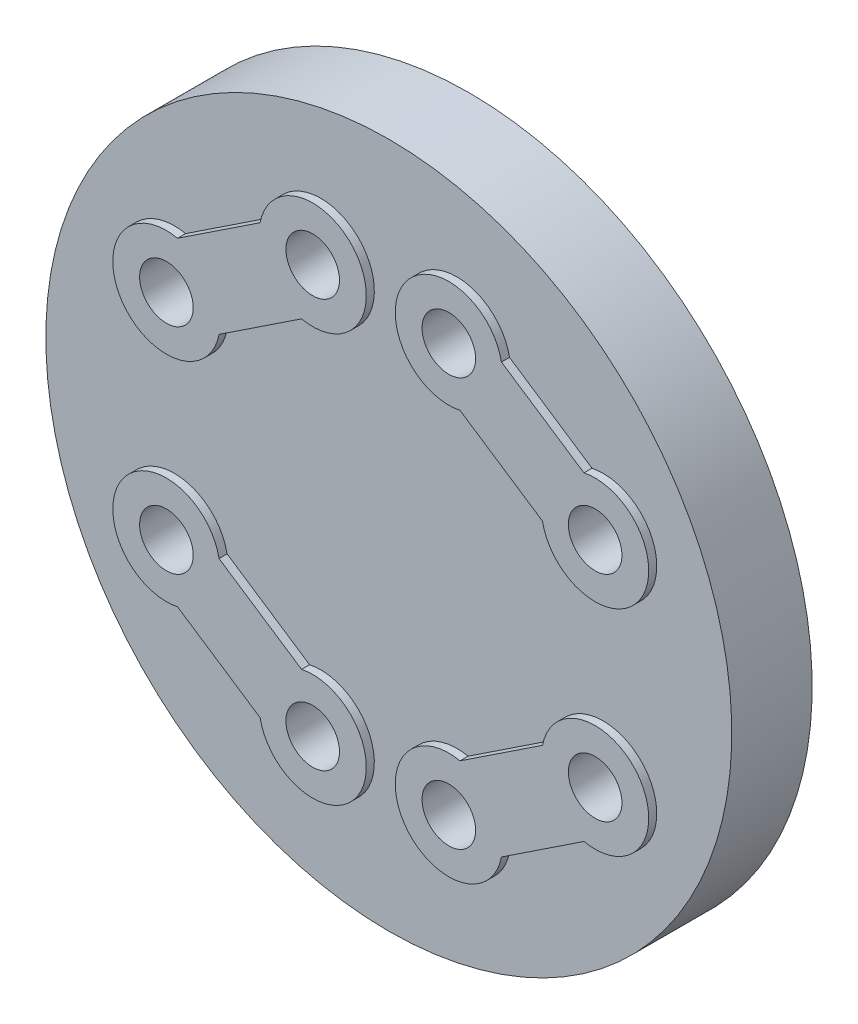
ISO-10303-21;
HEADER;
FILE_DESCRIPTION(('STEP AP214'),'2;1');
FILE_NAME('part.step','',(''),(''),'','','');
FILE_SCHEMA(('AUTOMOTIVE_DESIGN { 1 0 10303 214 1 1 1 1 }'));
ENDSEC;
DATA;
#1=APPLICATION_CONTEXT('core data for automotive mechanical design processes');
#2=APPLICATION_PROTOCOL_DEFINITION('international standard','automotive_design',2000,#1);
#3=PRODUCT_CONTEXT('',#1,'mechanical');
#4=PRODUCT('Part','Part','',(#3));
#5=PRODUCT_RELATED_PRODUCT_CATEGORY('part','',(#4));
#6=PRODUCT_DEFINITION_FORMATION('','',#4);
#7=PRODUCT_DEFINITION_CONTEXT('part definition',#1,'design');
#8=PRODUCT_DEFINITION('design','',#6,#7);
#9=PRODUCT_DEFINITION_SHAPE('','',#8);
#10=(LENGTH_UNIT() NAMED_UNIT(*) SI_UNIT(.MILLI.,.METRE.));
#11=(NAMED_UNIT(*) PLANE_ANGLE_UNIT() SI_UNIT($,.RADIAN.));
#12=(NAMED_UNIT(*) SI_UNIT($,.STERADIAN.) SOLID_ANGLE_UNIT());
#13=UNCERTAINTY_MEASURE_WITH_UNIT(LENGTH_MEASURE(1.E-05),#10,'distance_accuracy_value','');
#14=(GEOMETRIC_REPRESENTATION_CONTEXT(3) GLOBAL_UNCERTAINTY_ASSIGNED_CONTEXT((#13)) GLOBAL_UNIT_ASSIGNED_CONTEXT((#10,
#11,#12)) REPRESENTATION_CONTEXT('',''));
#15=CARTESIAN_POINT('',(0.,0.,0.));
#16=DIRECTION('',(0.,0.,1.));
#17=DIRECTION('',(1.,0.,0.));
#18=AXIS2_PLACEMENT_3D('',#15,#16,#17);
#19=CARTESIAN_POINT('',(-3.79160226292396,-2.978044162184,1.50000000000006));
#20=DIRECTION('',(-0.552584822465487,-0.833456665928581,0.));
#21=DIRECTION('',(0.833456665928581,-0.552584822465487,0.));
#22=AXIS2_PLACEMENT_3D('',#19,#20,#21);
#23=PLANE('',#22);
#24=DIRECTION('',(0.,0.,1.));
#25=VECTOR('',#24,1.);
#26=CARTESIAN_POINT('',(-2.2520164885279,-3.99879517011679,1.50000000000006));
#27=LINE('',#26,#25);
#28=CARTESIAN_POINT('',(-2.25201648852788,-3.9987951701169,1.64999999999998));
#29=VERTEX_POINT('',#28);
#30=CARTESIAN_POINT('',(-2.25201648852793,-3.99879517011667,1.5));
#31=VERTEX_POINT('',#30);
#32=EDGE_CURVE('E179',#29,#31,#27,.F.);
#33=ORIENTED_EDGE('',*,*,#32,.F.);
#34=DIRECTION('',(0.833456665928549,-0.552584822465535,0.));
#35=VECTOR('',#34,1.);
#36=CARTESIAN_POINT('',(-3.79160226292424,-2.97804416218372,1.65000000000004));
#37=LINE('',#36,#35);
#38=CARTESIAN_POINT('',(-3.7916022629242,-2.97804416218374,1.65000000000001));
#39=VERTEX_POINT('',#38);
#40=EDGE_CURVE('E280',#39,#29,#37,.T.);
#41=ORIENTED_EDGE('',*,*,#40,.F.);
#42=DIRECTION('',(0.,0.,1.));
#43=VECTOR('',#42,1.);
#44=CARTESIAN_POINT('',(-3.79160226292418,-2.97804416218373,1.5));
#45=LINE('',#44,#43);
#46=CARTESIAN_POINT('',(-3.79160226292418,-2.97804416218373,1.5));
#47=VERTEX_POINT('',#46);
#48=EDGE_CURVE('E185',#47,#39,#45,.T.);
#49=ORIENTED_EDGE('',*,*,#48,.F.);
#50=DIRECTION('',(-0.833456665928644,0.552584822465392,0.));
#51=VECTOR('',#50,1.);
#52=CARTESIAN_POINT('',(-2.2520164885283,-3.99879517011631,1.5));
#53=LINE('',#52,#51);
#54=EDGE_CURVE('E260',#31,#47,#53,.T.);
#55=ORIENTED_EDGE('',*,*,#54,.F.);
#56=EDGE_LOOP('',(#33,#41,#49,#55));
#57=FACE_BOUND('',#56,.T.);
#58=ADVANCED_FACE('F16',(#57),#23,.T.);
#59=CARTESIAN_POINT('',(-4.,-2.,1.5));
#60=DIRECTION('',(0.,0.,1.));
#61=DIRECTION('',(0.,-1.,0.));
#62=AXIS2_PLACEMENT_3D('',#59,#60,#61);
#63=CYLINDRICAL_SURFACE('',#62,1.);
#64=ORIENTED_EDGE('',*,*,#48,.T.);
#65=CARTESIAN_POINT('',(-4.,-2.,1.64999999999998));
#66=DIRECTION('',(0.,0.,1.));
#67=DIRECTION('',(0.,-1.,0.));
#68=AXIS2_PLACEMENT_3D('',#65,#66,#67);
#69=CIRCLE('',#68,1.);
#70=CARTESIAN_POINT('',(-3.01798351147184,-1.81120482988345,1.64999999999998));
#71=VERTEX_POINT('',#70);
#72=EDGE_CURVE('E281',#71,#39,#69,.T.);
#73=ORIENTED_EDGE('',*,*,#72,.F.);
#74=DIRECTION('',(0.,0.,1.));
#75=VECTOR('',#74,1.);
#76=CARTESIAN_POINT('',(-3.01798351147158,-1.8112048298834,1.5));
#77=LINE('',#76,#75);
#78=CARTESIAN_POINT('',(-3.01798351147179,-1.81120482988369,1.5));
#79=VERTEX_POINT('',#78);
#80=EDGE_CURVE('E183',#79,#71,#77,.T.);
#81=ORIENTED_EDGE('',*,*,#80,.F.);
#82=CARTESIAN_POINT('',(-4.,-2.,1.5));
#83=DIRECTION('',(0.,0.,1.));
#84=DIRECTION('',(0.,-1.,0.));
#85=AXIS2_PLACEMENT_3D('',#82,#83,#84);
#86=CIRCLE('',#85,1.);
#87=EDGE_CURVE('E258',#47,#79,#86,.F.);
#88=ORIENTED_EDGE('',*,*,#87,.F.);
#89=EDGE_LOOP('',(#64,#73,#81,#88));
#90=FACE_BOUND('',#89,.T.);
#91=ADVANCED_FACE('F295',(#90),#63,.T.);
#92=CARTESIAN_POINT('',(-1.47839773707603,-2.83195583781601,1.5));
#93=DIRECTION('',(0.552584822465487,0.833456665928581,0.));
#94=DIRECTION('',(-0.833456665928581,0.552584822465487,0.));
#95=AXIS2_PLACEMENT_3D('',#92,#93,#94);
#96=PLANE('',#95);
#97=ORIENTED_EDGE('',*,*,#80,.T.);
#98=DIRECTION('',(-0.833456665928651,0.552584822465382,0.));
#99=VECTOR('',#98,1.);
#100=CARTESIAN_POINT('',(-1.47839773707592,-2.83195583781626,1.65000000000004));
#101=LINE('',#100,#99);
#102=CARTESIAN_POINT('',(-1.47839773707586,-2.83195583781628,1.65000000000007));
#103=VERTEX_POINT('',#102);
#104=EDGE_CURVE('E152',#103,#71,#101,.T.);
#105=ORIENTED_EDGE('',*,*,#104,.F.);
#106=DIRECTION('',(0.,0.,1.));
#107=VECTOR('',#106,1.);
#108=CARTESIAN_POINT('',(-1.47839773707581,-2.83195583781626,1.50000000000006));
#109=LINE('',#108,#107);
#110=CARTESIAN_POINT('',(-1.47839773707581,-2.83195583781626,1.50000000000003));
#111=VERTEX_POINT('',#110);
#112=EDGE_CURVE('E181',#111,#103,#109,.T.);
#113=ORIENTED_EDGE('',*,*,#112,.F.);
#114=DIRECTION('',(0.833456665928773,-0.552584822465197,0.));
#115=VECTOR('',#114,1.);
#116=CARTESIAN_POINT('',(-3.01798351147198,-1.81120482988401,1.5));
#117=LINE('',#116,#115);
#118=EDGE_CURVE('E257',#79,#111,#117,.T.);
#119=ORIENTED_EDGE('',*,*,#118,.F.);
#120=EDGE_LOOP('',(#97,#105,#113,#119));
#121=FACE_BOUND('',#120,.T.);
#122=ADVANCED_FACE('F308',(#121),#96,.T.);
#123=CARTESIAN_POINT('',(-1.27000000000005,-3.81000000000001,1.50000000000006));
#124=DIRECTION('',(0.,0.,1.));
#125=DIRECTION('',(0.,-1.,0.));
#126=AXIS2_PLACEMENT_3D('',#123,#124,#125);
#127=CYLINDRICAL_SURFACE('',#126,1.);
#128=CARTESIAN_POINT('',(-1.27000000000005,-3.81000000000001,1.6500000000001));
#129=DIRECTION('',(0.,0.,1.));
#130=DIRECTION('',(0.,-1.,0.));
#131=AXIS2_PLACEMENT_3D('',#128,#129,#130);
#132=CIRCLE('',#131,1.);
#133=EDGE_CURVE('E277',#29,#103,#132,.T.);
#134=ORIENTED_EDGE('',*,*,#133,.F.);
#135=ORIENTED_EDGE('',*,*,#32,.T.);
#136=CARTESIAN_POINT('',(-1.27000000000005,-3.81000000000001,1.5));
#137=DIRECTION('',(0.,0.,1.));
#138=DIRECTION('',(0.,-1.,0.));
#139=AXIS2_PLACEMENT_3D('',#136,#137,#138);
#140=CIRCLE('',#139,1.);
#141=EDGE_CURVE('E254',#111,#31,#140,.F.);
#142=ORIENTED_EDGE('',*,*,#141,.F.);
#143=ORIENTED_EDGE('',*,*,#112,.T.);
#144=EDGE_LOOP('',(#134,#135,#142,#143));
#145=FACE_BOUND('',#144,.T.);
#146=ADVANCED_FACE('F303',(#145),#127,.T.);
#147=CARTESIAN_POINT('',(1.26999999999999,-3.81000000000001,1.5));
#148=DIRECTION('',(0.,0.,1.));
#149=DIRECTION('',(0.,-1.,0.));
#150=AXIS2_PLACEMENT_3D('',#147,#148,#149);
#151=CYLINDRICAL_SURFACE('',#150,1.);
#152=DIRECTION('',(0.,0.,1.));
#153=VECTOR('',#152,1.);
#154=CARTESIAN_POINT('',(2.25201648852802,-3.998795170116,1.50000000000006));
#155=LINE('',#154,#153);
#156=CARTESIAN_POINT('',(2.25201648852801,-3.99879517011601,1.65000000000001));
#157=VERTEX_POINT('',#156);
#158=CARTESIAN_POINT('',(2.25201648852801,-3.99879517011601,1.5));
#159=VERTEX_POINT('',#158);
#160=EDGE_CURVE('E139',#157,#159,#155,.F.);
#161=ORIENTED_EDGE('',*,*,#160,.F.);
#162=CARTESIAN_POINT('',(1.26999999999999,-3.81000000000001,1.64999999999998));
#163=DIRECTION('',(0.,0.,1.));
#164=DIRECTION('',(0.,-1.,0.));
#165=AXIS2_PLACEMENT_3D('',#162,#163,#164);
#166=CIRCLE('',#165,1.);
#167=CARTESIAN_POINT('',(1.47839773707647,-2.83195583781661,1.65000000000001));
#168=VERTEX_POINT('',#167);
#169=EDGE_CURVE('E19',#168,#157,#166,.T.);
#170=ORIENTED_EDGE('',*,*,#169,.F.);
#171=DIRECTION('',(0.,0.,1.));
#172=VECTOR('',#171,1.);
#173=CARTESIAN_POINT('',(1.47839773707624,-2.83195583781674,1.5));
#174=LINE('',#173,#172);
#175=CARTESIAN_POINT('',(1.47839773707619,-2.83195583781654,1.5));
#176=VERTEX_POINT('',#175);
#177=EDGE_CURVE('E177',#176,#168,#174,.T.);
#178=ORIENTED_EDGE('',*,*,#177,.F.);
#179=CARTESIAN_POINT('',(1.26999999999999,-3.81000000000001,1.5));
#180=DIRECTION('',(0.,0.,1.));
#181=DIRECTION('',(0.,-1.,0.));
#182=AXIS2_PLACEMENT_3D('',#179,#180,#181);
#183=CIRCLE('',#182,1.);
#184=EDGE_CURVE('E141',#159,#176,#183,.F.);
#185=ORIENTED_EDGE('',*,*,#184,.F.);
#186=EDGE_LOOP('',(#161,#170,#178,#185));
#187=FACE_BOUND('',#186,.T.);
#188=ADVANCED_FACE('F140',(#187),#151,.T.);
#189=CARTESIAN_POINT('',(3.01798351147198,-1.81120482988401,1.5));
#190=DIRECTION('',(-0.552584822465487,0.833456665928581,0.));
#191=DIRECTION('',(-0.833456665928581,-0.552584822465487,0.));
#192=AXIS2_PLACEMENT_3D('',#189,#190,#191);
#193=PLANE('',#192);
#194=ORIENTED_EDGE('',*,*,#177,.T.);
#195=DIRECTION('',(-0.833456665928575,-0.552584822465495,0.));
#196=VECTOR('',#195,1.);
#197=CARTESIAN_POINT('',(3.01798351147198,-1.81120482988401,1.65000000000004));
#198=LINE('',#197,#196);
#199=CARTESIAN_POINT('',(3.017983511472,-1.811204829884,1.65000000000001));
#200=VERTEX_POINT('',#199);
#201=EDGE_CURVE('E135',#200,#168,#198,.T.);
#202=ORIENTED_EDGE('',*,*,#201,.F.);
#203=DIRECTION('',(0.,0.,1.));
#204=VECTOR('',#203,1.);
#205=CARTESIAN_POINT('',(3.017983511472,-1.81120482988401,1.5));
#206=LINE('',#205,#204);
#207=CARTESIAN_POINT('',(3.017983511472,-1.811204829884,1.5));
#208=VERTEX_POINT('',#207);
#209=EDGE_CURVE('E146',#208,#200,#206,.T.);
#210=ORIENTED_EDGE('',*,*,#209,.F.);
#211=DIRECTION('',(0.833456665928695,0.552584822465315,0.));
#212=VECTOR('',#211,1.);
#213=CARTESIAN_POINT('',(1.47839773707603,-2.83195583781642,1.5));
#214=LINE('',#213,#212);
#215=EDGE_CURVE('E252',#176,#208,#214,.T.);
#216=ORIENTED_EDGE('',*,*,#215,.F.);
#217=EDGE_LOOP('',(#194,#202,#210,#216));
#218=FACE_BOUND('',#217,.T.);
#219=ADVANCED_FACE('F414',(#218),#193,.T.);
#220=CARTESIAN_POINT('',(4.,-2.,1.5));
#221=DIRECTION('',(0.,0.,1.));
#222=DIRECTION('',(0.,-1.,0.));
#223=AXIS2_PLACEMENT_3D('',#220,#221,#222);
#224=CYLINDRICAL_SURFACE('',#223,0.999999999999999);
#225=CARTESIAN_POINT('',(4.,-2.,1.64999999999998));
#226=DIRECTION('',(0.,0.,1.));
#227=DIRECTION('',(0.,-1.,0.));
#228=AXIS2_PLACEMENT_3D('',#225,#226,#227);
#229=CIRCLE('',#228,0.999999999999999);
#230=CARTESIAN_POINT('',(3.79160226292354,-2.9780441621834,1.65000000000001));
#231=VERTEX_POINT('',#230);
#232=EDGE_CURVE('E150',#231,#200,#229,.T.);
#233=ORIENTED_EDGE('',*,*,#232,.F.);
#234=DIRECTION('',(0.,0.,1.));
#235=VECTOR('',#234,1.);
#236=CARTESIAN_POINT('',(3.79160226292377,-2.97804416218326,1.50000000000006));
#237=LINE('',#236,#235);
#238=CARTESIAN_POINT('',(3.79160226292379,-2.97804416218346,1.5));
#239=VERTEX_POINT('',#238);
#240=EDGE_CURVE('E145',#239,#231,#237,.T.);
#241=ORIENTED_EDGE('',*,*,#240,.F.);
#242=CARTESIAN_POINT('',(4.,-2.,1.5));
#243=DIRECTION('',(0.,0.,1.));
#244=DIRECTION('',(0.,-1.,0.));
#245=AXIS2_PLACEMENT_3D('',#242,#243,#244);
#246=CIRCLE('',#245,0.999999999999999);
#247=EDGE_CURVE('E249',#208,#239,#246,.F.);
#248=ORIENTED_EDGE('',*,*,#247,.F.);
#249=ORIENTED_EDGE('',*,*,#209,.T.);
#250=EDGE_LOOP('',(#233,#241,#248,#249));
#251=FACE_BOUND('',#250,.T.);
#252=ADVANCED_FACE('F411',(#251),#224,.T.);
#253=CARTESIAN_POINT('',(2.25201648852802,-3.998795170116,1.50000000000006));
#254=DIRECTION('',(0.552584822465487,-0.833456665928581,0.));
#255=DIRECTION('',(0.833456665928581,0.552584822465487,0.));
#256=AXIS2_PLACEMENT_3D('',#253,#254,#255);
#257=PLANE('',#256);
#258=ORIENTED_EDGE('',*,*,#240,.T.);
#259=DIRECTION('',(0.833456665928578,0.552584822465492,0.));
#260=VECTOR('',#259,1.);
#261=CARTESIAN_POINT('',(2.25201648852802,-3.998795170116,1.65000000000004));
#262=LINE('',#261,#260);
#263=EDGE_CURVE('E132',#157,#231,#262,.T.);
#264=ORIENTED_EDGE('',*,*,#263,.F.);
#265=ORIENTED_EDGE('',*,*,#160,.T.);
#266=DIRECTION('',(-0.833456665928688,-0.552584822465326,0.));
#267=VECTOR('',#266,1.);
#268=CARTESIAN_POINT('',(3.79160226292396,-2.97804416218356,1.5));
#269=LINE('',#268,#267);
#270=EDGE_CURVE('E251',#239,#159,#269,.T.);
#271=ORIENTED_EDGE('',*,*,#270,.F.);
#272=EDGE_LOOP('',(#258,#264,#265,#271));
#273=FACE_BOUND('',#272,.T.);
#274=ADVANCED_FACE('F148',(#273),#257,.T.);
#275=CARTESIAN_POINT('',(1.47839773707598,2.83195583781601,1.5));
#276=DIRECTION('',(-0.552584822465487,-0.833456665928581,0.));
#277=DIRECTION('',(0.833456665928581,-0.552584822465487,0.));
#278=AXIS2_PLACEMENT_3D('',#275,#276,#277);
#279=PLANE('',#278);
#280=DIRECTION('',(0.,0.,1.));
#281=VECTOR('',#280,1.);
#282=CARTESIAN_POINT('',(3.01798351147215,1.81120482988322,1.5));
#283=LINE('',#282,#281);
#284=CARTESIAN_POINT('',(3.01798351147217,1.8112048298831,1.64999999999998));
#285=VERTEX_POINT('',#284);
#286=CARTESIAN_POINT('',(3.01798351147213,1.81120482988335,1.5));
#287=VERTEX_POINT('',#286);
#288=EDGE_CURVE('E166',#285,#287,#283,.F.);
#289=ORIENTED_EDGE('',*,*,#288,.F.);
#290=DIRECTION('',(0.833456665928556,-0.552584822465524,0.));
#291=VECTOR('',#290,1.);
#292=CARTESIAN_POINT('',(1.47839773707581,2.83195583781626,1.65000000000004));
#293=LINE('',#292,#291);
#294=CARTESIAN_POINT('',(1.4783977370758,2.83195583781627,1.65000000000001));
#295=VERTEX_POINT('',#294);
#296=EDGE_CURVE('E264',#295,#285,#293,.T.);
#297=ORIENTED_EDGE('',*,*,#296,.F.);
#298=DIRECTION('',(0.,0.,1.));
#299=VECTOR('',#298,1.);
#300=CARTESIAN_POINT('',(1.47839773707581,2.83195583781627,1.5));
#301=LINE('',#300,#299);
#302=CARTESIAN_POINT('',(1.4783977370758,2.83195583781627,1.50000000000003));
#303=VERTEX_POINT('',#302);
#304=EDGE_CURVE('E172',#303,#295,#301,.T.);
#305=ORIENTED_EDGE('',*,*,#304,.F.);
#306=DIRECTION('',(-0.833456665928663,0.552584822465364,0.));
#307=VECTOR('',#306,1.);
#308=CARTESIAN_POINT('',(3.01798351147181,1.81120482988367,1.5));
#309=LINE('',#308,#307);
#310=EDGE_CURVE('E248',#287,#303,#309,.T.);
#311=ORIENTED_EDGE('',*,*,#310,.F.);
#312=EDGE_LOOP('',(#289,#297,#305,#311));
#313=FACE_BOUND('',#312,.T.);
#314=ADVANCED_FACE('F404',(#313),#279,.T.);
#315=CARTESIAN_POINT('',(1.26999999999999,3.81000000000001,1.5));
#316=DIRECTION('',(0.,0.,1.));
#317=DIRECTION('',(0.,-1.,0.));
#318=AXIS2_PLACEMENT_3D('',#315,#316,#317);
#319=CYLINDRICAL_SURFACE('',#318,1.);
#320=ORIENTED_EDGE('',*,*,#304,.T.);
#321=CARTESIAN_POINT('',(1.26999999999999,3.81000000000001,1.64999999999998));
#322=DIRECTION('',(0.,0.,1.));
#323=DIRECTION('',(0.,-1.,0.));
#324=AXIS2_PLACEMENT_3D('',#321,#322,#323);
#325=CIRCLE('',#324,1.);
#326=CARTESIAN_POINT('',(2.25201648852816,3.99879517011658,1.64999999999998));
#327=VERTEX_POINT('',#326);
#328=EDGE_CURVE('E265',#327,#295,#325,.T.);
#329=ORIENTED_EDGE('',*,*,#328,.F.);
#330=DIRECTION('',(0.,0.,1.));
#331=VECTOR('',#330,1.);
#332=CARTESIAN_POINT('',(2.25201648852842,3.99879517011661,1.5));
#333=LINE('',#332,#331);
#334=CARTESIAN_POINT('',(2.25201648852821,3.99879517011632,1.50000000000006));
#335=VERTEX_POINT('',#334);
#336=EDGE_CURVE('E170',#335,#327,#333,.T.);
#337=ORIENTED_EDGE('',*,*,#336,.F.);
#338=CARTESIAN_POINT('',(1.26999999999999,3.81000000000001,1.50000000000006));
#339=DIRECTION('',(0.,0.,1.));
#340=DIRECTION('',(0.,-1.,0.));
#341=AXIS2_PLACEMENT_3D('',#338,#339,#340);
#342=CIRCLE('',#341,1.);
#343=EDGE_CURVE('E246',#303,#335,#342,.F.);
#344=ORIENTED_EDGE('',*,*,#343,.F.);
#345=EDGE_LOOP('',(#320,#329,#337,#344));
#346=FACE_BOUND('',#345,.T.);
#347=ADVANCED_FACE('F400',(#346),#319,.T.);
#348=CARTESIAN_POINT('',(3.79160226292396,2.978044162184,1.5));
#349=DIRECTION('',(0.552584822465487,0.833456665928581,0.));
#350=DIRECTION('',(-0.833456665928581,0.552584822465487,0.));
#351=AXIS2_PLACEMENT_3D('',#348,#349,#350);
#352=PLANE('',#351);
#353=ORIENTED_EDGE('',*,*,#336,.T.);
#354=DIRECTION('',(-0.833456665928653,0.552584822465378,0.));
#355=VECTOR('',#354,1.);
#356=CARTESIAN_POINT('',(3.79160226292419,2.97804416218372,1.65000000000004));
#357=LINE('',#356,#355);
#358=CARTESIAN_POINT('',(3.79160226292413,2.97804416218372,1.64999999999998));
#359=VERTEX_POINT('',#358);
#360=EDGE_CURVE('E268',#359,#327,#357,.T.);
#361=ORIENTED_EDGE('',*,*,#360,.F.);
#362=DIRECTION('',(0.,0.,1.));
#363=VECTOR('',#362,1.);
#364=CARTESIAN_POINT('',(3.79160226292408,2.97804416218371,1.5));
#365=LINE('',#364,#363);
#366=CARTESIAN_POINT('',(3.79160226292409,2.97804416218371,1.5));
#367=VERTEX_POINT('',#366);
#368=EDGE_CURVE('E168',#367,#359,#365,.T.);
#369=ORIENTED_EDGE('',*,*,#368,.F.);
#370=DIRECTION('',(0.833456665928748,-0.552584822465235,0.));
#371=VECTOR('',#370,1.);
#372=CARTESIAN_POINT('',(2.25201648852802,3.998795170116,1.5));
#373=LINE('',#372,#371);
#374=EDGE_CURVE('E245',#335,#367,#373,.T.);
#375=ORIENTED_EDGE('',*,*,#374,.F.);
#376=EDGE_LOOP('',(#353,#361,#369,#375));
#377=FACE_BOUND('',#376,.T.);
#378=ADVANCED_FACE('F396',(#377),#352,.T.);
#379=CARTESIAN_POINT('',(4.,2.,1.5));
#380=DIRECTION('',(0.,0.,1.));
#381=DIRECTION('',(0.,-1.,0.));
#382=AXIS2_PLACEMENT_3D('',#379,#380,#381);
#383=CYLINDRICAL_SURFACE('',#382,0.999999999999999);
#384=CARTESIAN_POINT('',(4.,2.,1.64999999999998));
#385=DIRECTION('',(0.,0.,1.));
#386=DIRECTION('',(0.,-1.,0.));
#387=AXIS2_PLACEMENT_3D('',#384,#385,#386);
#388=CIRCLE('',#387,0.999999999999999);
#389=EDGE_CURVE('E261',#285,#359,#388,.T.);
#390=ORIENTED_EDGE('',*,*,#389,.F.);
#391=ORIENTED_EDGE('',*,*,#288,.T.);
#392=CARTESIAN_POINT('',(4.,2.,1.5));
#393=DIRECTION('',(0.,0.,1.));
#394=DIRECTION('',(0.,-1.,0.));
#395=AXIS2_PLACEMENT_3D('',#392,#393,#394);
#396=CIRCLE('',#395,0.999999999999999);
#397=EDGE_CURVE('E242',#367,#287,#396,.F.);
#398=ORIENTED_EDGE('',*,*,#397,.F.);
#399=ORIENTED_EDGE('',*,*,#368,.T.);
#400=EDGE_LOOP('',(#390,#391,#398,#399));
#401=FACE_BOUND('',#400,.T.);
#402=ADVANCED_FACE('F392',(#401),#383,.T.);
#403=CARTESIAN_POINT('',(-2.25201648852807,3.998795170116,1.5));
#404=DIRECTION('',(-0.552584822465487,0.833456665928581,0.));
#405=DIRECTION('',(-0.833456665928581,-0.552584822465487,0.));
#406=AXIS2_PLACEMENT_3D('',#403,#404,#405);
#407=PLANE('',#406);
#408=DIRECTION('',(0.,0.,1.));
#409=VECTOR('',#408,1.);
#410=CARTESIAN_POINT('',(-3.79160226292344,2.97804416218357,1.5));
#411=LINE('',#410,#409);
#412=CARTESIAN_POINT('',(-3.79160226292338,2.97804416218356,1.65000000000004));
#413=VERTEX_POINT('',#412);
#414=CARTESIAN_POINT('',(-3.79160226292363,2.97804416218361,1.5));
#415=VERTEX_POINT('',#414);
#416=EDGE_CURVE('E158',#413,#415,#411,.F.);
#417=ORIENTED_EDGE('',*,*,#416,.F.);
#418=DIRECTION('',(-0.833456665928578,-0.552584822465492,0.));
#419=VECTOR('',#418,1.);
#420=CARTESIAN_POINT('',(-2.25201648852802,3.998795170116,1.65000000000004));
#421=LINE('',#420,#419);
#422=CARTESIAN_POINT('',(-2.25201648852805,3.99879517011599,1.65000000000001));
#423=VERTEX_POINT('',#422);
#424=EDGE_CURVE('E272',#423,#413,#421,.T.);
#425=ORIENTED_EDGE('',*,*,#424,.F.);
#426=DIRECTION('',(0.,0.,1.));
#427=VECTOR('',#426,1.);
#428=CARTESIAN_POINT('',(-2.25201648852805,3.998795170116,1.50000000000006));
#429=LINE('',#428,#427);
#430=CARTESIAN_POINT('',(-2.25201648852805,3.99879517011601,1.50000000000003));
#431=VERTEX_POINT('',#430);
#432=EDGE_CURVE('E164',#431,#423,#429,.T.);
#433=ORIENTED_EDGE('',*,*,#432,.F.);
#434=DIRECTION('',(0.833456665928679,0.552584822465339,0.));
#435=VECTOR('',#434,1.);
#436=CARTESIAN_POINT('',(-3.79160226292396,2.97804416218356,1.5));
#437=LINE('',#436,#435);
#438=EDGE_CURVE('E241',#415,#431,#437,.T.);
#439=ORIENTED_EDGE('',*,*,#438,.F.);
#440=EDGE_LOOP('',(#417,#425,#433,#439));
#441=FACE_BOUND('',#440,.T.);
#442=ADVANCED_FACE('F388',(#441),#407,.T.);
#443=CARTESIAN_POINT('',(-1.27000000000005,3.81000000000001,1.50000000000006));
#444=DIRECTION('',(0.,0.,1.));
#445=DIRECTION('',(0.,-1.,0.));
#446=AXIS2_PLACEMENT_3D('',#443,#444,#445);
#447=CYLINDRICAL_SURFACE('',#446,1.);
#448=CARTESIAN_POINT('',(-1.27000000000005,3.81000000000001,1.64999999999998));
#449=DIRECTION('',(0.,0.,1.));
#450=DIRECTION('',(0.,-1.,0.));
#451=AXIS2_PLACEMENT_3D('',#448,#449,#450);
#452=CIRCLE('',#451,1.);
#453=CARTESIAN_POINT('',(-1.47839773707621,2.83195583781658,1.64999999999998));
#454=VERTEX_POINT('',#453);
#455=EDGE_CURVE('E273',#454,#423,#452,.T.);
#456=ORIENTED_EDGE('',*,*,#455,.F.);
#457=DIRECTION('',(0.,0.,1.));
#458=VECTOR('',#457,1.);
#459=CARTESIAN_POINT('',(-1.47839773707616,2.83195583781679,1.5));
#460=LINE('',#459,#458);
#461=CARTESIAN_POINT('',(-1.47839773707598,2.83195583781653,1.5));
#462=VERTEX_POINT('',#461);
#463=EDGE_CURVE('E160',#462,#454,#460,.T.);
#464=ORIENTED_EDGE('',*,*,#463,.F.);
#465=CARTESIAN_POINT('',(-1.27000000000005,3.81000000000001,1.5));
#466=DIRECTION('',(0.,0.,1.));
#467=DIRECTION('',(0.,-1.,0.));
#468=AXIS2_PLACEMENT_3D('',#465,#466,#467);
#469=CIRCLE('',#468,1.);
#470=EDGE_CURVE('E239',#431,#462,#469,.F.);
#471=ORIENTED_EDGE('',*,*,#470,.F.);
#472=ORIENTED_EDGE('',*,*,#432,.T.);
#473=EDGE_LOOP('',(#456,#464,#471,#472));
#474=FACE_BOUND('',#473,.T.);
#475=ADVANCED_FACE('F384',(#474),#447,.T.);
#476=CARTESIAN_POINT('',(-3.01798351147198,1.81120482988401,1.5));
#477=DIRECTION('',(0.552584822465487,-0.833456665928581,0.));
#478=DIRECTION('',(0.833456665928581,0.552584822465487,0.));
#479=AXIS2_PLACEMENT_3D('',#476,#477,#478);
#480=PLANE('',#479);
#481=ORIENTED_EDGE('',*,*,#463,.T.);
#482=DIRECTION('',(0.833456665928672,0.55258482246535,0.));
#483=VECTOR('',#482,1.);
#484=CARTESIAN_POINT('',(-3.01798351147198,1.81120482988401,1.65000000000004));
#485=LINE('',#484,#483);
#486=CARTESIAN_POINT('',(-3.017983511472,1.811204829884,1.65000000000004));
#487=VERTEX_POINT('',#486);
#488=EDGE_CURVE('E276',#487,#454,#485,.T.);
#489=ORIENTED_EDGE('',*,*,#488,.F.);
#490=DIRECTION('',(0.,0.,1.));
#491=VECTOR('',#490,1.);
#492=CARTESIAN_POINT('',(-3.017983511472,1.81120482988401,1.5));
#493=LINE('',#492,#491);
#494=CARTESIAN_POINT('',(-3.017983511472,1.811204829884,1.5));
#495=VERTEX_POINT('',#494);
#496=EDGE_CURVE('E157',#495,#487,#493,.T.);
#497=ORIENTED_EDGE('',*,*,#496,.F.);
#498=DIRECTION('',(-0.833456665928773,-0.552584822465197,0.));
#499=VECTOR('',#498,1.);
#500=CARTESIAN_POINT('',(-1.47839773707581,2.83195583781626,1.5));
#501=LINE('',#500,#499);
#502=EDGE_CURVE('E34',#462,#495,#501,.T.);
#503=ORIENTED_EDGE('',*,*,#502,.F.);
#504=EDGE_LOOP('',(#481,#489,#497,#503));
#505=FACE_BOUND('',#504,.T.);
#506=ADVANCED_FACE('F380',(#505),#480,.T.);
#507=CARTESIAN_POINT('',(-4.,2.,1.5));
#508=DIRECTION('',(0.,0.,1.));
#509=DIRECTION('',(0.,-1.,0.));
#510=AXIS2_PLACEMENT_3D('',#507,#508,#509);
#511=CYLINDRICAL_SURFACE('',#510,1.);
#512=ORIENTED_EDGE('',*,*,#496,.T.);
#513=CARTESIAN_POINT('',(-4.,2.,1.65000000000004));
#514=DIRECTION('',(0.,0.,1.));
#515=DIRECTION('',(0.,-1.,0.));
#516=AXIS2_PLACEMENT_3D('',#513,#514,#515);
#517=CIRCLE('',#516,1.);
#518=EDGE_CURVE('E269',#413,#487,#517,.T.);
#519=ORIENTED_EDGE('',*,*,#518,.F.);
#520=ORIENTED_EDGE('',*,*,#416,.T.);
#521=CARTESIAN_POINT('',(-4.,2.,1.5));
#522=DIRECTION('',(0.,0.,1.));
#523=DIRECTION('',(0.,-1.,0.));
#524=AXIS2_PLACEMENT_3D('',#521,#522,#523);
#525=CIRCLE('',#524,1.);
#526=EDGE_CURVE('E237',#495,#415,#525,.F.);
#527=ORIENTED_EDGE('',*,*,#526,.F.);
#528=EDGE_LOOP('',(#512,#519,#520,#527));
#529=FACE_BOUND('',#528,.T.);
#530=ADVANCED_FACE('F377',(#529),#511,.T.);
#531=CARTESIAN_POINT('',(0.,0.,1.65000000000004));
#532=DIRECTION('',(0.,0.,1.));
#533=DIRECTION('',(0.,-1.,0.));
#534=AXIS2_PLACEMENT_3D('',#531,#532,#533);
#535=PLANE('',#534);
#536=ORIENTED_EDGE('',*,*,#263,.T.);
#537=ORIENTED_EDGE('',*,*,#232,.T.);
#538=ORIENTED_EDGE('',*,*,#201,.T.);
#539=ORIENTED_EDGE('',*,*,#169,.T.);
#540=EDGE_LOOP('',(#536,#537,#538,#539));
#541=FACE_BOUND('',#540,.T.);
#542=CARTESIAN_POINT('',(1.26999999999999,-3.81000000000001,1.6500000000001));
#543=DIRECTION('',(0.,0.,1.));
#544=DIRECTION('',(0.,-1.,0.));
#545=AXIS2_PLACEMENT_3D('',#542,#543,#544);
#546=CIRCLE('',#545,0.5);
#547=CARTESIAN_POINT('',(1.26999999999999,-4.31000000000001,1.6500000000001));
#548=VERTEX_POINT('',#547);
#549=EDGE_CURVE('E231',#548,#548,#546,.F.);
#550=ORIENTED_EDGE('',*,*,#549,.T.);
#551=EDGE_LOOP('',(#550));
#552=FACE_BOUND('',#551,.T.);
#553=CARTESIAN_POINT('',(4.,-2.,1.64999999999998));
#554=DIRECTION('',(0.,0.,1.));
#555=DIRECTION('',(0.,-1.,0.));
#556=AXIS2_PLACEMENT_3D('',#553,#554,#555);
#557=CIRCLE('',#556,0.5);
#558=CARTESIAN_POINT('',(4.,-2.5,1.64999999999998));
#559=VERTEX_POINT('',#558);
#560=EDGE_CURVE('E234',#559,#559,#557,.F.);
#561=ORIENTED_EDGE('',*,*,#560,.T.);
#562=EDGE_LOOP('',(#561));
#563=FACE_BOUND('',#562,.T.);
#564=ADVANCED_FACE('F128',(#541,#552,#563),#535,.T.);
#565=CARTESIAN_POINT('',(0.,0.,1.65000000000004));
#566=DIRECTION('',(0.,0.,1.));
#567=DIRECTION('',(0.,-1.,0.));
#568=AXIS2_PLACEMENT_3D('',#565,#566,#567);
#569=PLANE('',#568);
#570=ORIENTED_EDGE('',*,*,#40,.T.);
#571=ORIENTED_EDGE('',*,*,#133,.T.);
#572=ORIENTED_EDGE('',*,*,#104,.T.);
#573=ORIENTED_EDGE('',*,*,#72,.T.);
#574=EDGE_LOOP('',(#570,#571,#572,#573));
#575=FACE_BOUND('',#574,.T.);
#576=CARTESIAN_POINT('',(-1.27000000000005,-3.81000000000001,1.64999999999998));
#577=DIRECTION('',(0.,0.,1.));
#578=DIRECTION('',(0.,-1.,0.));
#579=AXIS2_PLACEMENT_3D('',#576,#577,#578);
#580=CIRCLE('',#579,0.5);
#581=CARTESIAN_POINT('',(-1.27000000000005,-4.31000000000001,1.64999999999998));
#582=VERTEX_POINT('',#581);
#583=EDGE_CURVE('E228',#582,#582,#580,.F.);
#584=ORIENTED_EDGE('',*,*,#583,.T.);
#585=EDGE_LOOP('',(#584));
#586=FACE_BOUND('',#585,.T.);
#587=CARTESIAN_POINT('',(-4.,-2.,1.64999999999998));
#588=DIRECTION('',(0.,0.,1.));
#589=DIRECTION('',(0.,-1.,0.));
#590=AXIS2_PLACEMENT_3D('',#587,#588,#589);
#591=CIRCLE('',#590,0.5);
#592=CARTESIAN_POINT('',(-4.,-2.5,1.64999999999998));
#593=VERTEX_POINT('',#592);
#594=EDGE_CURVE('E225',#593,#593,#591,.F.);
#595=ORIENTED_EDGE('',*,*,#594,.T.);
#596=EDGE_LOOP('',(#595));
#597=FACE_BOUND('',#596,.T.);
#598=ADVANCED_FACE('F289',(#575,#586,#597),#569,.T.);
#599=CARTESIAN_POINT('',(0.,0.,1.65000000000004));
#600=DIRECTION('',(0.,0.,1.));
#601=DIRECTION('',(0.,-1.,0.));
#602=AXIS2_PLACEMENT_3D('',#599,#600,#601);
#603=PLANE('',#602);
#604=ORIENTED_EDGE('',*,*,#424,.T.);
#605=ORIENTED_EDGE('',*,*,#518,.T.);
#606=ORIENTED_EDGE('',*,*,#488,.T.);
#607=ORIENTED_EDGE('',*,*,#455,.T.);
#608=EDGE_LOOP('',(#604,#605,#606,#607));
#609=FACE_BOUND('',#608,.T.);
#610=CARTESIAN_POINT('',(-1.27000000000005,3.81000000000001,1.64999999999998));
#611=DIRECTION('',(0.,0.,1.));
#612=DIRECTION('',(0.,-1.,0.));
#613=AXIS2_PLACEMENT_3D('',#610,#611,#612);
#614=CIRCLE('',#613,0.5);
#615=CARTESIAN_POINT('',(-1.27000000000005,3.31000000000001,1.64999999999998));
#616=VERTEX_POINT('',#615);
#617=EDGE_CURVE('E219',#616,#616,#614,.F.);
#618=ORIENTED_EDGE('',*,*,#617,.T.);
#619=EDGE_LOOP('',(#618));
#620=FACE_BOUND('',#619,.T.);
#621=CARTESIAN_POINT('',(-4.,2.,1.64999999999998));
#622=DIRECTION('',(0.,0.,1.));
#623=DIRECTION('',(0.,-1.,0.));
#624=AXIS2_PLACEMENT_3D('',#621,#622,#623);
#625=CIRCLE('',#624,0.5);
#626=CARTESIAN_POINT('',(-4.,1.5,1.64999999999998));
#627=VERTEX_POINT('',#626);
#628=EDGE_CURVE('E222',#627,#627,#625,.F.);
#629=ORIENTED_EDGE('',*,*,#628,.T.);
#630=EDGE_LOOP('',(#629));
#631=FACE_BOUND('',#630,.T.);
#632=ADVANCED_FACE('F368',(#609,#620,#631),#603,.T.);
#633=CARTESIAN_POINT('',(0.,0.,1.65000000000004));
#634=DIRECTION('',(0.,0.,1.));
#635=DIRECTION('',(0.,-1.,0.));
#636=AXIS2_PLACEMENT_3D('',#633,#634,#635);
#637=PLANE('',#636);
#638=ORIENTED_EDGE('',*,*,#296,.T.);
#639=ORIENTED_EDGE('',*,*,#389,.T.);
#640=ORIENTED_EDGE('',*,*,#360,.T.);
#641=ORIENTED_EDGE('',*,*,#328,.T.);
#642=EDGE_LOOP('',(#638,#639,#640,#641));
#643=FACE_BOUND('',#642,.T.);
#644=CARTESIAN_POINT('',(1.26999999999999,3.81000000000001,1.6500000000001));
#645=DIRECTION('',(0.,0.,1.));
#646=DIRECTION('',(0.,-1.,0.));
#647=AXIS2_PLACEMENT_3D('',#644,#645,#646);
#648=CIRCLE('',#647,0.5);
#649=CARTESIAN_POINT('',(1.26999999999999,3.31000000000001,1.6500000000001));
#650=VERTEX_POINT('',#649);
#651=EDGE_CURVE('E216',#650,#650,#648,.F.);
#652=ORIENTED_EDGE('',*,*,#651,.T.);
#653=EDGE_LOOP('',(#652));
#654=FACE_BOUND('',#653,.T.);
#655=CARTESIAN_POINT('',(4.,2.,1.64999999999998));
#656=DIRECTION('',(0.,0.,1.));
#657=DIRECTION('',(0.,-1.,0.));
#658=AXIS2_PLACEMENT_3D('',#655,#656,#657);
#659=CIRCLE('',#658,0.5);
#660=CARTESIAN_POINT('',(4.,1.5,1.64999999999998));
#661=VERTEX_POINT('',#660);
#662=EDGE_CURVE('E213',#661,#661,#659,.F.);
#663=ORIENTED_EDGE('',*,*,#662,.T.);
#664=EDGE_LOOP('',(#663));
#665=FACE_BOUND('',#664,.T.);
#666=ADVANCED_FACE('F364',(#643,#654,#665),#637,.T.);
#667=CARTESIAN_POINT('',(0.,0.,1.5));
#668=DIRECTION('',(0.,0.,1.));
#669=DIRECTION('',(0.,-1.,0.));
#670=AXIS2_PLACEMENT_3D('',#667,#668,#669);
#671=PLANE('',#670);
#672=CARTESIAN_POINT('',(0.,0.,1.5));
#673=DIRECTION('',(0.,0.,1.));
#674=DIRECTION('',(0.,-1.,0.));
#675=AXIS2_PLACEMENT_3D('',#672,#673,#674);
#676=CIRCLE('',#675,6.4);
#677=CARTESIAN_POINT('',(0.,-6.4,1.5));
#678=VERTEX_POINT('',#677);
#679=EDGE_CURVE('E210',#678,#678,#676,.F.);
#680=ORIENTED_EDGE('',*,*,#679,.F.);
#681=EDGE_LOOP('',(#680));
#682=FACE_BOUND('',#681,.T.);
#683=ORIENTED_EDGE('',*,*,#502,.T.);
#684=ORIENTED_EDGE('',*,*,#526,.T.);
#685=ORIENTED_EDGE('',*,*,#438,.T.);
#686=ORIENTED_EDGE('',*,*,#470,.T.);
#687=EDGE_LOOP('',(#683,#684,#685,#686));
#688=FACE_BOUND('',#687,.T.);
#689=ORIENTED_EDGE('',*,*,#374,.T.);
#690=ORIENTED_EDGE('',*,*,#397,.T.);
#691=ORIENTED_EDGE('',*,*,#310,.T.);
#692=ORIENTED_EDGE('',*,*,#343,.T.);
#693=EDGE_LOOP('',(#689,#690,#691,#692));
#694=FACE_BOUND('',#693,.T.);
#695=ORIENTED_EDGE('',*,*,#247,.T.);
#696=ORIENTED_EDGE('',*,*,#270,.T.);
#697=ORIENTED_EDGE('',*,*,#184,.T.);
#698=ORIENTED_EDGE('',*,*,#215,.T.);
#699=EDGE_LOOP('',(#695,#696,#697,#698));
#700=FACE_BOUND('',#699,.T.);
#701=ORIENTED_EDGE('',*,*,#118,.T.);
#702=ORIENTED_EDGE('',*,*,#141,.T.);
#703=ORIENTED_EDGE('',*,*,#54,.T.);
#704=ORIENTED_EDGE('',*,*,#87,.T.);
#705=EDGE_LOOP('',(#701,#702,#703,#704));
#706=FACE_BOUND('',#705,.T.);
#707=ADVANCED_FACE('F306',(#682,#688,#694,#700,#706),#671,.T.);
#708=CARTESIAN_POINT('',(4.,-2.,1.5));
#709=DIRECTION('',(0.,0.,1.));
#710=DIRECTION('',(0.,-1.,0.));
#711=AXIS2_PLACEMENT_3D('',#708,#709,#710);
#712=CYLINDRICAL_SURFACE('',#711,0.5);
#713=ORIENTED_EDGE('',*,*,#560,.F.);
#714=EDGE_LOOP('',(#713));
#715=FACE_BOUND('',#714,.T.);
#716=CARTESIAN_POINT('',(4.,-2.,0.));
#717=DIRECTION('',(0.,0.,1.));
#718=DIRECTION('',(0.,-1.,0.));
#719=AXIS2_PLACEMENT_3D('',#716,#717,#718);
#720=CIRCLE('',#719,0.5);
#721=CARTESIAN_POINT('',(4.,-2.5,0.));
#722=VERTEX_POINT('',#721);
#723=EDGE_CURVE('E207',#722,#722,#720,.F.);
#724=ORIENTED_EDGE('',*,*,#723,.T.);
#725=EDGE_LOOP('',(#724));
#726=FACE_BOUND('',#725,.T.);
#727=ADVANCED_FACE('F357',(#715,#726),#712,.F.);
#728=CARTESIAN_POINT('',(1.26999999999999,-3.81000000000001,1.5));
#729=DIRECTION('',(0.,0.,1.));
#730=DIRECTION('',(0.,-1.,0.));
#731=AXIS2_PLACEMENT_3D('',#728,#729,#730);
#732=CYLINDRICAL_SURFACE('',#731,0.5);
#733=ORIENTED_EDGE('',*,*,#549,.F.);
#734=EDGE_LOOP('',(#733));
#735=FACE_BOUND('',#734,.T.);
#736=CARTESIAN_POINT('',(1.26999999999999,-3.81000000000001,0.));
#737=DIRECTION('',(0.,0.,1.));
#738=DIRECTION('',(0.,-1.,0.));
#739=AXIS2_PLACEMENT_3D('',#736,#737,#738);
#740=CIRCLE('',#739,0.5);
#741=CARTESIAN_POINT('',(1.26999999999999,-4.31000000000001,0.));
#742=VERTEX_POINT('',#741);
#743=EDGE_CURVE('E204',#742,#742,#740,.F.);
#744=ORIENTED_EDGE('',*,*,#743,.T.);
#745=EDGE_LOOP('',(#744));
#746=FACE_BOUND('',#745,.T.);
#747=ADVANCED_FACE('F353',(#735,#746),#732,.F.);
#748=CARTESIAN_POINT('',(-1.27000000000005,-3.81000000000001,1.50000000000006));
#749=DIRECTION('',(0.,0.,1.));
#750=DIRECTION('',(0.,-1.,0.));
#751=AXIS2_PLACEMENT_3D('',#748,#749,#750);
#752=CYLINDRICAL_SURFACE('',#751,0.5);
#753=ORIENTED_EDGE('',*,*,#583,.F.);
#754=EDGE_LOOP('',(#753));
#755=FACE_BOUND('',#754,.T.);
#756=CARTESIAN_POINT('',(-1.27000000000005,-3.81000000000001,0.));
#757=DIRECTION('',(0.,0.,1.));
#758=DIRECTION('',(0.,-1.,0.));
#759=AXIS2_PLACEMENT_3D('',#756,#757,#758);
#760=CIRCLE('',#759,0.5);
#761=CARTESIAN_POINT('',(-1.27000000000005,-4.31000000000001,0.));
#762=VERTEX_POINT('',#761);
#763=EDGE_CURVE('E201',#762,#762,#760,.F.);
#764=ORIENTED_EDGE('',*,*,#763,.T.);
#765=EDGE_LOOP('',(#764));
#766=FACE_BOUND('',#765,.T.);
#767=ADVANCED_FACE('F349',(#755,#766),#752,.F.);
#768=CARTESIAN_POINT('',(-4.,-2.,1.5));
#769=DIRECTION('',(0.,0.,1.));
#770=DIRECTION('',(0.,-1.,0.));
#771=AXIS2_PLACEMENT_3D('',#768,#769,#770);
#772=CYLINDRICAL_SURFACE('',#771,0.5);
#773=ORIENTED_EDGE('',*,*,#594,.F.);
#774=EDGE_LOOP('',(#773));
#775=FACE_BOUND('',#774,.T.);
#776=CARTESIAN_POINT('',(-4.,-2.,0.));
#777=DIRECTION('',(0.,0.,1.));
#778=DIRECTION('',(0.,-1.,0.));
#779=AXIS2_PLACEMENT_3D('',#776,#777,#778);
#780=CIRCLE('',#779,0.5);
#781=CARTESIAN_POINT('',(-4.,-2.5,0.));
#782=VERTEX_POINT('',#781);
#783=EDGE_CURVE('E198',#782,#782,#780,.F.);
#784=ORIENTED_EDGE('',*,*,#783,.T.);
#785=EDGE_LOOP('',(#784));
#786=FACE_BOUND('',#785,.T.);
#787=ADVANCED_FACE('F345',(#775,#786),#772,.F.);
#788=CARTESIAN_POINT('',(-4.,2.,1.5));
#789=DIRECTION('',(0.,0.,1.));
#790=DIRECTION('',(0.,-1.,0.));
#791=AXIS2_PLACEMENT_3D('',#788,#789,#790);
#792=CYLINDRICAL_SURFACE('',#791,0.5);
#793=ORIENTED_EDGE('',*,*,#628,.F.);
#794=EDGE_LOOP('',(#793));
#795=FACE_BOUND('',#794,.T.);
#796=CARTESIAN_POINT('',(-4.,2.,0.));
#797=DIRECTION('',(0.,0.,1.));
#798=DIRECTION('',(0.,-1.,0.));
#799=AXIS2_PLACEMENT_3D('',#796,#797,#798);
#800=CIRCLE('',#799,0.5);
#801=CARTESIAN_POINT('',(-4.,1.5,0.));
#802=VERTEX_POINT('',#801);
#803=EDGE_CURVE('E195',#802,#802,#800,.F.);
#804=ORIENTED_EDGE('',*,*,#803,.T.);
#805=EDGE_LOOP('',(#804));
#806=FACE_BOUND('',#805,.T.);
#807=ADVANCED_FACE('F341',(#795,#806),#792,.F.);
#808=CARTESIAN_POINT('',(-1.27000000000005,3.81000000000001,1.50000000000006));
#809=DIRECTION('',(0.,0.,1.));
#810=DIRECTION('',(0.,-1.,0.));
#811=AXIS2_PLACEMENT_3D('',#808,#809,#810);
#812=CYLINDRICAL_SURFACE('',#811,0.5);
#813=ORIENTED_EDGE('',*,*,#617,.F.);
#814=EDGE_LOOP('',(#813));
#815=FACE_BOUND('',#814,.T.);
#816=CARTESIAN_POINT('',(-1.27000000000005,3.81000000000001,0.));
#817=DIRECTION('',(0.,0.,1.));
#818=DIRECTION('',(0.,-1.,0.));
#819=AXIS2_PLACEMENT_3D('',#816,#817,#818);
#820=CIRCLE('',#819,0.5);
#821=CARTESIAN_POINT('',(-1.27000000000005,3.31000000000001,0.));
#822=VERTEX_POINT('',#821);
#823=EDGE_CURVE('E192',#822,#822,#820,.F.);
#824=ORIENTED_EDGE('',*,*,#823,.T.);
#825=EDGE_LOOP('',(#824));
#826=FACE_BOUND('',#825,.T.);
#827=ADVANCED_FACE('F337',(#815,#826),#812,.F.);
#828=CARTESIAN_POINT('',(1.26999999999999,3.81000000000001,1.5));
#829=DIRECTION('',(0.,0.,1.));
#830=DIRECTION('',(0.,-1.,0.));
#831=AXIS2_PLACEMENT_3D('',#828,#829,#830);
#832=CYLINDRICAL_SURFACE('',#831,0.5);
#833=ORIENTED_EDGE('',*,*,#651,.F.);
#834=EDGE_LOOP('',(#833));
#835=FACE_BOUND('',#834,.T.);
#836=CARTESIAN_POINT('',(1.26999999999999,3.81000000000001,0.));
#837=DIRECTION('',(0.,0.,1.));
#838=DIRECTION('',(0.,-1.,0.));
#839=AXIS2_PLACEMENT_3D('',#836,#837,#838);
#840=CIRCLE('',#839,0.5);
#841=CARTESIAN_POINT('',(1.26999999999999,3.31000000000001,0.));
#842=VERTEX_POINT('',#841);
#843=EDGE_CURVE('E189',#842,#842,#840,.F.);
#844=ORIENTED_EDGE('',*,*,#843,.T.);
#845=EDGE_LOOP('',(#844));
#846=FACE_BOUND('',#845,.T.);
#847=ADVANCED_FACE('F333',(#835,#846),#832,.F.);
#848=CARTESIAN_POINT('',(4.,2.,1.5));
#849=DIRECTION('',(0.,0.,1.));
#850=DIRECTION('',(0.,-1.,0.));
#851=AXIS2_PLACEMENT_3D('',#848,#849,#850);
#852=CYLINDRICAL_SURFACE('',#851,0.5);
#853=ORIENTED_EDGE('',*,*,#662,.F.);
#854=EDGE_LOOP('',(#853));
#855=FACE_BOUND('',#854,.T.);
#856=CARTESIAN_POINT('',(4.,2.,0.));
#857=DIRECTION('',(0.,0.,1.));
#858=DIRECTION('',(0.,-1.,0.));
#859=AXIS2_PLACEMENT_3D('',#856,#857,#858);
#860=CIRCLE('',#859,0.5);
#861=CARTESIAN_POINT('',(4.,1.5,0.));
#862=VERTEX_POINT('',#861);
#863=EDGE_CURVE('E25',#862,#862,#860,.F.);
#864=ORIENTED_EDGE('',*,*,#863,.T.);
#865=EDGE_LOOP('',(#864));
#866=FACE_BOUND('',#865,.T.);
#867=ADVANCED_FACE('F325',(#855,#866),#852,.F.);
#868=CARTESIAN_POINT('',(0.,0.,0.));
#869=DIRECTION('',(0.,0.,1.));
#870=DIRECTION('',(0.,-1.,0.));
#871=AXIS2_PLACEMENT_3D('',#868,#869,#870);
#872=CYLINDRICAL_SURFACE('',#871,6.4);
#873=ORIENTED_EDGE('',*,*,#679,.T.);
#874=EDGE_LOOP('',(#873));
#875=FACE_BOUND('',#874,.T.);
#876=CARTESIAN_POINT('',(0.,0.,0.));
#877=DIRECTION('',(0.,0.,1.));
#878=DIRECTION('',(0.,-1.,0.));
#879=AXIS2_PLACEMENT_3D('',#876,#877,#878);
#880=CIRCLE('',#879,6.4);
#881=CARTESIAN_POINT('',(0.,-6.4,0.));
#882=VERTEX_POINT('',#881);
#883=EDGE_CURVE('E11',#882,#882,#880,.T.);
#884=ORIENTED_EDGE('',*,*,#883,.T.);
#885=EDGE_LOOP('',(#884));
#886=FACE_BOUND('',#885,.T.);
#887=ADVANCED_FACE('F319',(#875,#886),#872,.T.);
#888=CARTESIAN_POINT('',(0.,0.,0.));
#889=DIRECTION('',(0.,0.,1.));
#890=DIRECTION('',(0.,-1.,0.));
#891=AXIS2_PLACEMENT_3D('',#888,#889,#890);
#892=PLANE('',#891);
#893=ORIENTED_EDGE('',*,*,#883,.F.);
#894=EDGE_LOOP('',(#893));
#895=FACE_BOUND('',#894,.T.);
#896=ORIENTED_EDGE('',*,*,#863,.F.);
#897=EDGE_LOOP('',(#896));
#898=FACE_BOUND('',#897,.T.);
#899=ORIENTED_EDGE('',*,*,#843,.F.);
#900=EDGE_LOOP('',(#899));
#901=FACE_BOUND('',#900,.T.);
#902=ORIENTED_EDGE('',*,*,#823,.F.);
#903=EDGE_LOOP('',(#902));
#904=FACE_BOUND('',#903,.T.);
#905=ORIENTED_EDGE('',*,*,#803,.F.);
#906=EDGE_LOOP('',(#905));
#907=FACE_BOUND('',#906,.T.);
#908=ORIENTED_EDGE('',*,*,#783,.F.);
#909=EDGE_LOOP('',(#908));
#910=FACE_BOUND('',#909,.T.);
#911=ORIENTED_EDGE('',*,*,#763,.F.);
#912=EDGE_LOOP('',(#911));
#913=FACE_BOUND('',#912,.T.);
#914=ORIENTED_EDGE('',*,*,#743,.F.);
#915=EDGE_LOOP('',(#914));
#916=FACE_BOUND('',#915,.T.);
#917=ORIENTED_EDGE('',*,*,#723,.F.);
#918=EDGE_LOOP('',(#917));
#919=FACE_BOUND('',#918,.T.);
#920=ADVANCED_FACE('F317',(#895,#898,#901,#904,#907,#910,#913,#916,#919),#892,.F.);
#921=CLOSED_SHELL('',(#58,#91,#122,#146,#188,#219,#252,#274,#314,#347,#378,#402,#442,#475,#506,
#530,#564,#598,#632,#666,#707,#727,#747,#767,#787,#807,#827,#847,#867,#887,#920));
#922=MANIFOLD_SOLID_BREP('B1',#921);
#923=ADVANCED_BREP_SHAPE_REPRESENTATION('',(#18,#922),#14);
#924=SHAPE_DEFINITION_REPRESENTATION(#9,#923);
ENDSEC;
END-ISO-10303-21;
